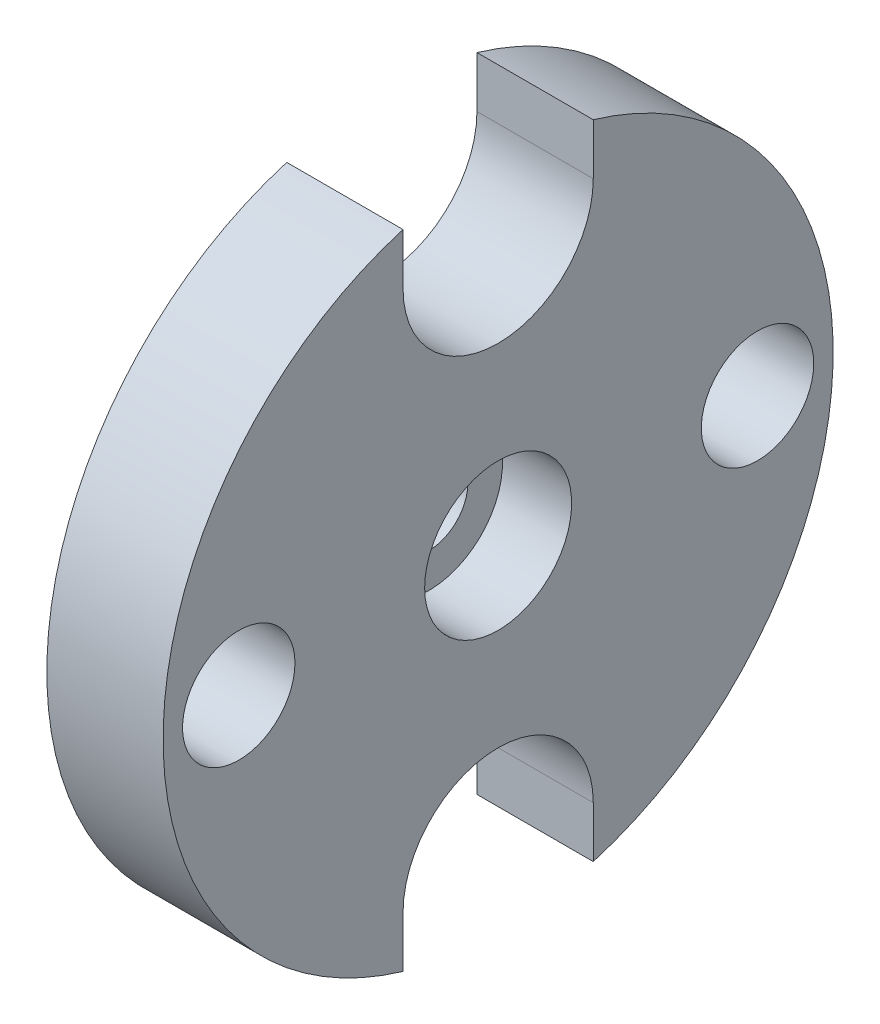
ISO-10303-21;
HEADER;
FILE_DESCRIPTION(('STEP AP214'),'2;1');
FILE_NAME('part.step','',(''),(''),'','','');
FILE_SCHEMA(('AUTOMOTIVE_DESIGN { 1 0 10303 214 1 1 1 1 }'));
ENDSEC;
DATA;
#1=APPLICATION_CONTEXT('core data for automotive mechanical design processes');
#2=APPLICATION_PROTOCOL_DEFINITION('international standard','automotive_design',2000,#1);
#3=PRODUCT_CONTEXT('',#1,'mechanical');
#4=PRODUCT('Part','Part','',(#3));
#5=PRODUCT_RELATED_PRODUCT_CATEGORY('part','',(#4));
#6=PRODUCT_DEFINITION_FORMATION('','',#4);
#7=PRODUCT_DEFINITION_CONTEXT('part definition',#1,'design');
#8=PRODUCT_DEFINITION('design','',#6,#7);
#9=PRODUCT_DEFINITION_SHAPE('','',#8);
#10=(LENGTH_UNIT() NAMED_UNIT(*) SI_UNIT(.MILLI.,.METRE.));
#11=(NAMED_UNIT(*) PLANE_ANGLE_UNIT() SI_UNIT($,.RADIAN.));
#12=(NAMED_UNIT(*) SI_UNIT($,.STERADIAN.) SOLID_ANGLE_UNIT());
#13=UNCERTAINTY_MEASURE_WITH_UNIT(LENGTH_MEASURE(1.E-05),#10,'distance_accuracy_value','');
#14=(GEOMETRIC_REPRESENTATION_CONTEXT(3) GLOBAL_UNCERTAINTY_ASSIGNED_CONTEXT((#13)) GLOBAL_UNIT_ASSIGNED_CONTEXT((#10,
#11,#12)) REPRESENTATION_CONTEXT('',''));
#15=CARTESIAN_POINT('',(0.,0.,0.));
#16=DIRECTION('',(0.,0.,1.));
#17=DIRECTION('',(1.,0.,0.));
#18=AXIS2_PLACEMENT_3D('',#15,#16,#17);
#19=CARTESIAN_POINT('',(0.,0.,0.));
#20=DIRECTION('',(-1.,0.,0.));
#21=DIRECTION('',(0.,0.,1.));
#22=AXIS2_PLACEMENT_3D('',#19,#20,#21);
#23=CYLINDRICAL_SURFACE('',#22,7.75);
#24=CARTESIAN_POINT('',(0.,0.,0.));
#25=DIRECTION('',(-1.,0.,0.));
#26=DIRECTION('',(0.,0.,1.));
#27=AXIS2_PLACEMENT_3D('',#24,#25,#26);
#28=CIRCLE('',#27,7.75);
#29=CARTESIAN_POINT('',(0.,-7.43118429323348,2.2));
#30=VERTEX_POINT('',#29);
#31=CARTESIAN_POINT('',(0.,7.43118429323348,2.2));
#32=VERTEX_POINT('',#31);
#33=EDGE_CURVE('E186',#30,#32,#28,.T.);
#34=ORIENTED_EDGE('',*,*,#33,.F.);
#35=DIRECTION('',(-1.,0.,0.));
#36=VECTOR('',#35,1.);
#37=CARTESIAN_POINT('',(0.,-7.43118429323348,2.2));
#38=LINE('',#37,#36);
#39=CARTESIAN_POINT('',(2.69,-7.43118429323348,2.2));
#40=VERTEX_POINT('',#39);
#41=EDGE_CURVE('E11',#30,#40,#38,.F.);
#42=ORIENTED_EDGE('',*,*,#41,.T.);
#43=CARTESIAN_POINT('',(2.69,0.,0.));
#44=DIRECTION('',(-1.,0.,0.));
#45=DIRECTION('',(0.,0.,1.));
#46=AXIS2_PLACEMENT_3D('',#43,#44,#45);
#47=CIRCLE('',#46,7.75);
#48=CARTESIAN_POINT('',(2.69,7.43118429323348,2.2));
#49=VERTEX_POINT('',#48);
#50=EDGE_CURVE('E182',#40,#49,#47,.T.);
#51=ORIENTED_EDGE('',*,*,#50,.T.);
#52=DIRECTION('',(-1.,0.,0.));
#53=VECTOR('',#52,1.);
#54=CARTESIAN_POINT('',(0.,7.43118429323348,2.2));
#55=LINE('',#54,#53);
#56=EDGE_CURVE('E190',#49,#32,#55,.T.);
#57=ORIENTED_EDGE('',*,*,#56,.T.);
#58=EDGE_LOOP('',(#34,#42,#51,#57));
#59=FACE_BOUND('',#58,.T.);
#60=ADVANCED_FACE('F32',(#59),#23,.T.);
#61=CARTESIAN_POINT('',(2.69,7.75,0.));
#62=DIRECTION('',(-1.,0.,0.));
#63=DIRECTION('',(0.,0.,1.));
#64=AXIS2_PLACEMENT_3D('',#61,#62,#63);
#65=PLANE('',#64);
#66=CARTESIAN_POINT('',(2.69,0.,-6.));
#67=DIRECTION('',(1.,0.,0.));
#68=DIRECTION('',(0.,0.,-1.));
#69=AXIS2_PLACEMENT_3D('',#66,#67,#68);
#70=CIRCLE('',#69,1.29999999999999);
#71=CARTESIAN_POINT('',(2.69,0.,-7.29999999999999));
#72=VERTEX_POINT('',#71);
#73=EDGE_CURVE('E144',#72,#72,#70,.T.);
#74=ORIENTED_EDGE('',*,*,#73,.F.);
#75=EDGE_LOOP('',(#74));
#76=FACE_BOUND('',#75,.T.);
#77=CARTESIAN_POINT('',(2.69,0.,6.));
#78=DIRECTION('',(1.,0.,0.));
#79=DIRECTION('',(0.,0.,-1.));
#80=AXIS2_PLACEMENT_3D('',#77,#78,#79);
#81=CIRCLE('',#80,1.29999999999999);
#82=CARTESIAN_POINT('',(2.69,0.,4.70000000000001));
#83=VERTEX_POINT('',#82);
#84=EDGE_CURVE('E152',#83,#83,#81,.T.);
#85=ORIENTED_EDGE('',*,*,#84,.F.);
#86=EDGE_LOOP('',(#85));
#87=FACE_BOUND('',#86,.T.);
#88=ORIENTED_EDGE('',*,*,#50,.F.);
#89=DIRECTION('',(0.,-1.,0.));
#90=VECTOR('',#89,1.);
#91=CARTESIAN_POINT('',(2.69,-7.75,2.2));
#92=LINE('',#91,#90);
#93=CARTESIAN_POINT('',(2.69,-6.25,2.2));
#94=VERTEX_POINT('',#93);
#95=EDGE_CURVE('E118',#94,#40,#92,.T.);
#96=ORIENTED_EDGE('',*,*,#95,.F.);
#97=CARTESIAN_POINT('',(2.69,-6.25,0.));
#98=DIRECTION('',(1.,0.,0.));
#99=DIRECTION('',(0.,0.,1.));
#100=AXIS2_PLACEMENT_3D('',#97,#98,#99);
#101=CIRCLE('',#100,2.2);
#102=CARTESIAN_POINT('',(2.69,-6.25,-2.2));
#103=VERTEX_POINT('',#102);
#104=EDGE_CURVE('E120',#103,#94,#101,.T.);
#105=ORIENTED_EDGE('',*,*,#104,.F.);
#106=DIRECTION('',(0.,1.,0.));
#107=VECTOR('',#106,1.);
#108=CARTESIAN_POINT('',(2.69,-7.75,-2.2));
#109=LINE('',#108,#107);
#110=CARTESIAN_POINT('',(2.69,-7.43118429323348,-2.2));
#111=VERTEX_POINT('',#110);
#112=EDGE_CURVE('E99',#111,#103,#109,.T.);
#113=ORIENTED_EDGE('',*,*,#112,.F.);
#114=CARTESIAN_POINT('',(2.69,7.43118429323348,-2.2));
#115=VERTEX_POINT('',#114);
#116=EDGE_CURVE('E183',#115,#111,#47,.T.);
#117=ORIENTED_EDGE('',*,*,#116,.F.);
#118=DIRECTION('',(0.,1.,0.));
#119=VECTOR('',#118,1.);
#120=CARTESIAN_POINT('',(2.69,7.75,-2.2));
#121=LINE('',#120,#119);
#122=CARTESIAN_POINT('',(2.69,6.25,-2.2));
#123=VERTEX_POINT('',#122);
#124=EDGE_CURVE('E55',#123,#115,#121,.T.);
#125=ORIENTED_EDGE('',*,*,#124,.F.);
#126=CARTESIAN_POINT('',(2.69,6.25,0.));
#127=DIRECTION('',(1.,0.,0.));
#128=DIRECTION('',(0.,0.,-1.));
#129=AXIS2_PLACEMENT_3D('',#126,#127,#128);
#130=CIRCLE('',#129,2.2);
#131=CARTESIAN_POINT('',(2.69,6.25,2.2));
#132=VERTEX_POINT('',#131);
#133=EDGE_CURVE('E138',#132,#123,#130,.T.);
#134=ORIENTED_EDGE('',*,*,#133,.F.);
#135=DIRECTION('',(0.,-1.,0.));
#136=VECTOR('',#135,1.);
#137=CARTESIAN_POINT('',(2.69,7.75,2.2));
#138=LINE('',#137,#136);
#139=EDGE_CURVE('E126',#49,#132,#138,.T.);
#140=ORIENTED_EDGE('',*,*,#139,.F.);
#141=EDGE_LOOP('',(#88,#96,#105,#113,#117,#125,#134,#140));
#142=FACE_BOUND('',#141,.T.);
#143=CARTESIAN_POINT('',(2.69,0.,0.));
#144=DIRECTION('',(-1.,0.,0.));
#145=DIRECTION('',(0.,0.,1.));
#146=AXIS2_PLACEMENT_3D('',#143,#144,#145);
#147=CIRCLE('',#146,1.7);
#148=CARTESIAN_POINT('',(2.69,0.,1.7));
#149=VERTEX_POINT('',#148);
#150=EDGE_CURVE('E179',#149,#149,#147,.T.);
#151=ORIENTED_EDGE('',*,*,#150,.T.);
#152=EDGE_LOOP('',(#151));
#153=FACE_BOUND('',#152,.T.);
#154=ADVANCED_FACE('F197',(#76,#87,#142,#153),#65,.F.);
#155=CARTESIAN_POINT('',(0.,0.,0.));
#156=DIRECTION('',(1.,0.,0.));
#157=DIRECTION('',(0.,0.,-1.));
#158=AXIS2_PLACEMENT_3D('',#155,#156,#157);
#159=PLANE('',#158);
#160=CARTESIAN_POINT('',(0.,-6.25,0.));
#161=DIRECTION('',(1.,0.,0.));
#162=DIRECTION('',(0.,0.,1.));
#163=AXIS2_PLACEMENT_3D('',#160,#161,#162);
#164=CIRCLE('',#163,2.2);
#165=CARTESIAN_POINT('',(0.,-6.25,-2.2));
#166=VERTEX_POINT('',#165);
#167=CARTESIAN_POINT('',(0.,-6.25,2.2));
#168=VERTEX_POINT('',#167);
#169=EDGE_CURVE('E107',#166,#168,#164,.T.);
#170=ORIENTED_EDGE('',*,*,#169,.T.);
#171=DIRECTION('',(0.,-1.,0.));
#172=VECTOR('',#171,1.);
#173=CARTESIAN_POINT('',(0.,-7.75,2.2));
#174=LINE('',#173,#172);
#175=EDGE_CURVE('E104',#168,#30,#174,.T.);
#176=ORIENTED_EDGE('',*,*,#175,.T.);
#177=ORIENTED_EDGE('',*,*,#33,.T.);
#178=DIRECTION('',(0.,-1.,0.));
#179=VECTOR('',#178,1.);
#180=CARTESIAN_POINT('',(0.,7.75,2.2));
#181=LINE('',#180,#179);
#182=CARTESIAN_POINT('',(0.,6.25,2.2));
#183=VERTEX_POINT('',#182);
#184=EDGE_CURVE('E128',#32,#183,#181,.T.);
#185=ORIENTED_EDGE('',*,*,#184,.T.);
#186=CARTESIAN_POINT('',(0.,6.25,0.));
#187=DIRECTION('',(1.,0.,0.));
#188=DIRECTION('',(0.,0.,-1.));
#189=AXIS2_PLACEMENT_3D('',#186,#187,#188);
#190=CIRCLE('',#189,2.2);
#191=CARTESIAN_POINT('',(0.,6.25,-2.2));
#192=VERTEX_POINT('',#191);
#193=EDGE_CURVE('E131',#183,#192,#190,.T.);
#194=ORIENTED_EDGE('',*,*,#193,.T.);
#195=DIRECTION('',(0.,1.,0.));
#196=VECTOR('',#195,1.);
#197=CARTESIAN_POINT('',(0.,7.75,-2.2));
#198=LINE('',#197,#196);
#199=CARTESIAN_POINT('',(0.,7.43118429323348,-2.2));
#200=VERTEX_POINT('',#199);
#201=EDGE_CURVE('E134',#192,#200,#198,.T.);
#202=ORIENTED_EDGE('',*,*,#201,.T.);
#203=CARTESIAN_POINT('',(0.,-7.43118429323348,-2.2));
#204=VERTEX_POINT('',#203);
#205=EDGE_CURVE('E117',#200,#204,#28,.T.);
#206=ORIENTED_EDGE('',*,*,#205,.T.);
#207=DIRECTION('',(0.,1.,0.));
#208=VECTOR('',#207,1.);
#209=CARTESIAN_POINT('',(0.,-7.75,-2.2));
#210=LINE('',#209,#208);
#211=EDGE_CURVE('E47',#204,#166,#210,.T.);
#212=ORIENTED_EDGE('',*,*,#211,.T.);
#213=EDGE_LOOP('',(#170,#176,#177,#185,#194,#202,#206,#212));
#214=FACE_BOUND('',#213,.T.);
#215=CARTESIAN_POINT('',(0.,0.,-6.));
#216=DIRECTION('',(1.,0.,0.));
#217=DIRECTION('',(0.,0.,-1.));
#218=AXIS2_PLACEMENT_3D('',#215,#216,#217);
#219=CIRCLE('',#218,1.3);
#220=CARTESIAN_POINT('',(0.,0.,-7.3));
#221=VERTEX_POINT('',#220);
#222=EDGE_CURVE('E149',#221,#221,#219,.T.);
#223=ORIENTED_EDGE('',*,*,#222,.T.);
#224=EDGE_LOOP('',(#223));
#225=FACE_BOUND('',#224,.T.);
#226=CARTESIAN_POINT('',(0.,0.,6.));
#227=DIRECTION('',(1.,0.,0.));
#228=DIRECTION('',(0.,0.,-1.));
#229=AXIS2_PLACEMENT_3D('',#226,#227,#228);
#230=CIRCLE('',#229,1.3);
#231=CARTESIAN_POINT('',(0.,0.,4.7));
#232=VERTEX_POINT('',#231);
#233=EDGE_CURVE('E155',#232,#232,#230,.T.);
#234=ORIENTED_EDGE('',*,*,#233,.T.);
#235=EDGE_LOOP('',(#234));
#236=FACE_BOUND('',#235,.T.);
#237=CARTESIAN_POINT('',(0.,0.28,0.));
#238=DIRECTION('',(1.,0.,0.));
#239=DIRECTION('',(0.,0.,-1.));
#240=AXIS2_PLACEMENT_3D('',#237,#238,#239);
#241=CIRCLE('',#240,0.15);
#242=CARTESIAN_POINT('',(0.,0.28,-0.15));
#243=VERTEX_POINT('',#242);
#244=EDGE_CURVE('E161',#243,#243,#241,.T.);
#245=ORIENTED_EDGE('',*,*,#244,.T.);
#246=EDGE_LOOP('',(#245));
#247=FACE_BOUND('',#246,.T.);
#248=CARTESIAN_POINT('',(0.,-0.28,0.));
#249=DIRECTION('',(1.,0.,0.));
#250=DIRECTION('',(0.,0.,-1.));
#251=AXIS2_PLACEMENT_3D('',#248,#249,#250);
#252=CIRCLE('',#251,0.15);
#253=CARTESIAN_POINT('',(0.,-0.28,-0.15));
#254=VERTEX_POINT('',#253);
#255=EDGE_CURVE('E167',#254,#254,#252,.T.);
#256=ORIENTED_EDGE('',*,*,#255,.T.);
#257=EDGE_LOOP('',(#256));
#258=FACE_BOUND('',#257,.T.);
#259=ADVANCED_FACE('F34',(#214,#225,#236,#247,#258),#159,.F.);
#260=ORIENTED_EDGE('',*,*,#116,.T.);
#261=DIRECTION('',(-1.,0.,0.));
#262=VECTOR('',#261,1.);
#263=CARTESIAN_POINT('',(0.,-7.43118429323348,-2.2));
#264=LINE('',#263,#262);
#265=EDGE_CURVE('E40',#111,#204,#264,.T.);
#266=ORIENTED_EDGE('',*,*,#265,.T.);
#267=ORIENTED_EDGE('',*,*,#205,.F.);
#268=DIRECTION('',(-1.,0.,0.));
#269=VECTOR('',#268,1.);
#270=CARTESIAN_POINT('',(0.,7.43118429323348,-2.2));
#271=LINE('',#270,#269);
#272=EDGE_CURVE('E188',#200,#115,#271,.F.);
#273=ORIENTED_EDGE('',*,*,#272,.T.);
#274=EDGE_LOOP('',(#260,#266,#267,#273));
#275=FACE_BOUND('',#274,.T.);
#276=ADVANCED_FACE('F193',(#275),#23,.T.);
#277=CARTESIAN_POINT('',(0.,0.,0.));
#278=DIRECTION('',(-1.,0.,0.));
#279=DIRECTION('',(0.,0.,1.));
#280=AXIS2_PLACEMENT_3D('',#277,#278,#279);
#281=CYLINDRICAL_SURFACE('',#280,1.7);
#282=CARTESIAN_POINT('',(1.09,0.,0.));
#283=DIRECTION('',(-1.,0.,0.));
#284=DIRECTION('',(0.,0.,1.));
#285=AXIS2_PLACEMENT_3D('',#282,#283,#284);
#286=CIRCLE('',#285,1.7);
#287=CARTESIAN_POINT('',(1.09,0.,1.7));
#288=VERTEX_POINT('',#287);
#289=EDGE_CURVE('E176',#288,#288,#286,.T.);
#290=ORIENTED_EDGE('',*,*,#289,.T.);
#291=EDGE_LOOP('',(#290));
#292=FACE_BOUND('',#291,.T.);
#293=ORIENTED_EDGE('',*,*,#150,.F.);
#294=EDGE_LOOP('',(#293));
#295=FACE_BOUND('',#294,.T.);
#296=ADVANCED_FACE('F232',(#292,#295),#281,.F.);
#297=CARTESIAN_POINT('',(1.09,1.7,0.));
#298=DIRECTION('',(1.,0.,0.));
#299=DIRECTION('',(0.,0.,-1.));
#300=AXIS2_PLACEMENT_3D('',#297,#298,#299);
#301=PLANE('',#300);
#302=CARTESIAN_POINT('',(1.09,0.,0.));
#303=DIRECTION('',(-1.,0.,0.));
#304=DIRECTION('',(0.,0.,1.));
#305=AXIS2_PLACEMENT_3D('',#302,#303,#304);
#306=CIRCLE('',#305,0.9);
#307=CARTESIAN_POINT('',(1.09,0.,0.9));
#308=VERTEX_POINT('',#307);
#309=EDGE_CURVE('E173',#308,#308,#306,.T.);
#310=ORIENTED_EDGE('',*,*,#309,.T.);
#311=EDGE_LOOP('',(#310));
#312=FACE_BOUND('',#311,.T.);
#313=ORIENTED_EDGE('',*,*,#289,.F.);
#314=EDGE_LOOP('',(#313));
#315=FACE_BOUND('',#314,.T.);
#316=ADVANCED_FACE('F237',(#312,#315),#301,.T.);
#317=CARTESIAN_POINT('',(0.,0.,0.));
#318=DIRECTION('',(-1.,0.,0.));
#319=DIRECTION('',(0.,0.,1.));
#320=AXIS2_PLACEMENT_3D('',#317,#318,#319);
#321=CYLINDRICAL_SURFACE('',#320,0.9);
#322=CARTESIAN_POINT('',(0.29,0.,0.));
#323=DIRECTION('',(-1.,0.,0.));
#324=DIRECTION('',(0.,0.,1.));
#325=AXIS2_PLACEMENT_3D('',#322,#323,#324);
#326=CIRCLE('',#325,0.9);
#327=CARTESIAN_POINT('',(0.29,0.,0.9));
#328=VERTEX_POINT('',#327);
#329=EDGE_CURVE('E170',#328,#328,#326,.T.);
#330=ORIENTED_EDGE('',*,*,#329,.T.);
#331=EDGE_LOOP('',(#330));
#332=FACE_BOUND('',#331,.T.);
#333=ORIENTED_EDGE('',*,*,#309,.F.);
#334=EDGE_LOOP('',(#333));
#335=FACE_BOUND('',#334,.T.);
#336=ADVANCED_FACE('F302',(#332,#335),#321,.F.);
#337=CARTESIAN_POINT('',(0.29,0.9,0.));
#338=DIRECTION('',(1.,0.,0.));
#339=DIRECTION('',(0.,0.,-1.));
#340=AXIS2_PLACEMENT_3D('',#337,#338,#339);
#341=PLANE('',#340);
#342=CARTESIAN_POINT('',(0.29,0.28,0.));
#343=DIRECTION('',(1.,0.,0.));
#344=DIRECTION('',(0.,0.,-1.));
#345=AXIS2_PLACEMENT_3D('',#342,#343,#344);
#346=CIRCLE('',#345,0.15);
#347=CARTESIAN_POINT('',(0.29,0.28,-0.15));
#348=VERTEX_POINT('',#347);
#349=EDGE_CURVE('E158',#348,#348,#346,.T.);
#350=ORIENTED_EDGE('',*,*,#349,.F.);
#351=EDGE_LOOP('',(#350));
#352=FACE_BOUND('',#351,.T.);
#353=CARTESIAN_POINT('',(0.29,-0.28,0.));
#354=DIRECTION('',(1.,0.,0.));
#355=DIRECTION('',(0.,0.,-1.));
#356=AXIS2_PLACEMENT_3D('',#353,#354,#355);
#357=CIRCLE('',#356,0.15);
#358=CARTESIAN_POINT('',(0.29,-0.28,-0.15));
#359=VERTEX_POINT('',#358);
#360=EDGE_CURVE('E164',#359,#359,#357,.T.);
#361=ORIENTED_EDGE('',*,*,#360,.F.);
#362=EDGE_LOOP('',(#361));
#363=FACE_BOUND('',#362,.T.);
#364=ORIENTED_EDGE('',*,*,#329,.F.);
#365=EDGE_LOOP('',(#364));
#366=FACE_BOUND('',#365,.T.);
#367=ADVANCED_FACE('F292',(#352,#363,#366),#341,.T.);
#368=CARTESIAN_POINT('',(0.29,-0.28,0.));
#369=DIRECTION('',(1.,0.,0.));
#370=DIRECTION('',(0.,0.,-1.));
#371=AXIS2_PLACEMENT_3D('',#368,#369,#370);
#372=CYLINDRICAL_SURFACE('',#371,0.15);
#373=ORIENTED_EDGE('',*,*,#255,.F.);
#374=EDGE_LOOP('',(#373));
#375=FACE_BOUND('',#374,.T.);
#376=ORIENTED_EDGE('',*,*,#360,.T.);
#377=EDGE_LOOP('',(#376));
#378=FACE_BOUND('',#377,.T.);
#379=ADVANCED_FACE('F282',(#375,#378),#372,.F.);
#380=CARTESIAN_POINT('',(0.29,0.28,0.));
#381=DIRECTION('',(1.,0.,0.));
#382=DIRECTION('',(0.,0.,-1.));
#383=AXIS2_PLACEMENT_3D('',#380,#381,#382);
#384=CYLINDRICAL_SURFACE('',#383,0.15);
#385=ORIENTED_EDGE('',*,*,#244,.F.);
#386=EDGE_LOOP('',(#385));
#387=FACE_BOUND('',#386,.T.);
#388=ORIENTED_EDGE('',*,*,#349,.T.);
#389=EDGE_LOOP('',(#388));
#390=FACE_BOUND('',#389,.T.);
#391=ADVANCED_FACE('F272',(#387,#390),#384,.F.);
#392=CARTESIAN_POINT('',(2.69,0.,6.));
#393=DIRECTION('',(1.,0.,0.));
#394=DIRECTION('',(0.,0.,-1.));
#395=AXIS2_PLACEMENT_3D('',#392,#393,#394);
#396=CYLINDRICAL_SURFACE('',#395,1.29999999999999);
#397=ORIENTED_EDGE('',*,*,#233,.F.);
#398=EDGE_LOOP('',(#397));
#399=FACE_BOUND('',#398,.T.);
#400=ORIENTED_EDGE('',*,*,#84,.T.);
#401=EDGE_LOOP('',(#400));
#402=FACE_BOUND('',#401,.T.);
#403=ADVANCED_FACE('F262',(#399,#402),#396,.F.);
#404=CARTESIAN_POINT('',(2.69,0.,-6.));
#405=DIRECTION('',(1.,0.,0.));
#406=DIRECTION('',(0.,0.,-1.));
#407=AXIS2_PLACEMENT_3D('',#404,#405,#406);
#408=CYLINDRICAL_SURFACE('',#407,1.29999999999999);
#409=ORIENTED_EDGE('',*,*,#222,.F.);
#410=EDGE_LOOP('',(#409));
#411=FACE_BOUND('',#410,.T.);
#412=ORIENTED_EDGE('',*,*,#73,.T.);
#413=EDGE_LOOP('',(#412));
#414=FACE_BOUND('',#413,.T.);
#415=ADVANCED_FACE('F222',(#411,#414),#408,.F.);
#416=CARTESIAN_POINT('',(0.,7.75,2.2));
#417=DIRECTION('',(0.,0.,1.));
#418=DIRECTION('',(0.,-1.,0.));
#419=AXIS2_PLACEMENT_3D('',#416,#417,#418);
#420=PLANE('',#419);
#421=ORIENTED_EDGE('',*,*,#139,.T.);
#422=DIRECTION('',(1.,0.,0.));
#423=VECTOR('',#422,1.);
#424=CARTESIAN_POINT('',(0.,6.25,2.2));
#425=LINE('',#424,#423);
#426=EDGE_CURVE('E136',#183,#132,#425,.T.);
#427=ORIENTED_EDGE('',*,*,#426,.F.);
#428=ORIENTED_EDGE('',*,*,#184,.F.);
#429=ORIENTED_EDGE('',*,*,#56,.F.);
#430=EDGE_LOOP('',(#421,#427,#428,#429));
#431=FACE_BOUND('',#430,.T.);
#432=ADVANCED_FACE('F208',(#431),#420,.F.);
#433=CARTESIAN_POINT('',(0.,7.75,-2.2));
#434=DIRECTION('',(0.,0.,-1.));
#435=DIRECTION('',(-1.,0.,0.));
#436=AXIS2_PLACEMENT_3D('',#433,#434,#435);
#437=PLANE('',#436);
#438=ORIENTED_EDGE('',*,*,#201,.F.);
#439=DIRECTION('',(1.,0.,0.));
#440=VECTOR('',#439,1.);
#441=CARTESIAN_POINT('',(0.,6.25,-2.2));
#442=LINE('',#441,#440);
#443=EDGE_CURVE('E142',#192,#123,#442,.T.);
#444=ORIENTED_EDGE('',*,*,#443,.T.);
#445=ORIENTED_EDGE('',*,*,#124,.T.);
#446=ORIENTED_EDGE('',*,*,#272,.F.);
#447=EDGE_LOOP('',(#438,#444,#445,#446));
#448=FACE_BOUND('',#447,.T.);
#449=ADVANCED_FACE('F214',(#448),#437,.F.);
#450=CARTESIAN_POINT('',(0.,6.25,0.));
#451=DIRECTION('',(1.,0.,0.));
#452=DIRECTION('',(0.,0.,-1.));
#453=AXIS2_PLACEMENT_3D('',#450,#451,#452);
#454=CYLINDRICAL_SURFACE('',#453,2.2);
#455=ORIENTED_EDGE('',*,*,#133,.T.);
#456=ORIENTED_EDGE('',*,*,#443,.F.);
#457=ORIENTED_EDGE('',*,*,#193,.F.);
#458=ORIENTED_EDGE('',*,*,#426,.T.);
#459=EDGE_LOOP('',(#455,#456,#457,#458));
#460=FACE_BOUND('',#459,.T.);
#461=ADVANCED_FACE('F212',(#460),#454,.F.);
#462=CARTESIAN_POINT('',(0.,-7.75,2.2));
#463=DIRECTION('',(0.,0.,1.));
#464=DIRECTION('',(0.,-1.,0.));
#465=AXIS2_PLACEMENT_3D('',#462,#463,#464);
#466=PLANE('',#465);
#467=ORIENTED_EDGE('',*,*,#175,.F.);
#468=DIRECTION('',(1.,0.,0.));
#469=VECTOR('',#468,1.);
#470=CARTESIAN_POINT('',(0.,-6.25,2.2));
#471=LINE('',#470,#469);
#472=EDGE_CURVE('E103',#168,#94,#471,.T.);
#473=ORIENTED_EDGE('',*,*,#472,.T.);
#474=ORIENTED_EDGE('',*,*,#95,.T.);
#475=ORIENTED_EDGE('',*,*,#41,.F.);
#476=EDGE_LOOP('',(#467,#473,#474,#475));
#477=FACE_BOUND('',#476,.T.);
#478=ADVANCED_FACE('F202',(#477),#466,.F.);
#479=CARTESIAN_POINT('',(0.,-7.75,-2.2));
#480=DIRECTION('',(0.,0.,-1.));
#481=DIRECTION('',(-1.,0.,0.));
#482=AXIS2_PLACEMENT_3D('',#479,#480,#481);
#483=PLANE('',#482);
#484=ORIENTED_EDGE('',*,*,#112,.T.);
#485=DIRECTION('',(1.,0.,0.));
#486=VECTOR('',#485,1.);
#487=CARTESIAN_POINT('',(0.,-6.25,-2.2));
#488=LINE('',#487,#486);
#489=EDGE_CURVE('E95',#166,#103,#488,.T.);
#490=ORIENTED_EDGE('',*,*,#489,.F.);
#491=ORIENTED_EDGE('',*,*,#211,.F.);
#492=ORIENTED_EDGE('',*,*,#265,.F.);
#493=EDGE_LOOP('',(#484,#490,#491,#492));
#494=FACE_BOUND('',#493,.T.);
#495=ADVANCED_FACE('F97',(#494),#483,.F.);
#496=CARTESIAN_POINT('',(0.,-6.25,0.));
#497=DIRECTION('',(1.,0.,0.));
#498=DIRECTION('',(0.,0.,-1.));
#499=AXIS2_PLACEMENT_3D('',#496,#497,#498);
#500=CYLINDRICAL_SURFACE('',#499,2.2);
#501=ORIENTED_EDGE('',*,*,#104,.T.);
#502=ORIENTED_EDGE('',*,*,#472,.F.);
#503=ORIENTED_EDGE('',*,*,#169,.F.);
#504=ORIENTED_EDGE('',*,*,#489,.T.);
#505=EDGE_LOOP('',(#501,#502,#503,#504));
#506=FACE_BOUND('',#505,.T.);
#507=ADVANCED_FACE('F108',(#506),#500,.F.);
#508=CLOSED_SHELL('',(#60,#154,#259,#276,#296,#316,#336,#367,#379,#391,#403,#415,#432,#449,#461,
#478,#495,#507));
#509=MANIFOLD_SOLID_BREP('B2',#508);
#510=ADVANCED_BREP_SHAPE_REPRESENTATION('',(#18,#509),#14);
#511=SHAPE_DEFINITION_REPRESENTATION(#9,#510);
ENDSEC;
END-ISO-10303-21;
